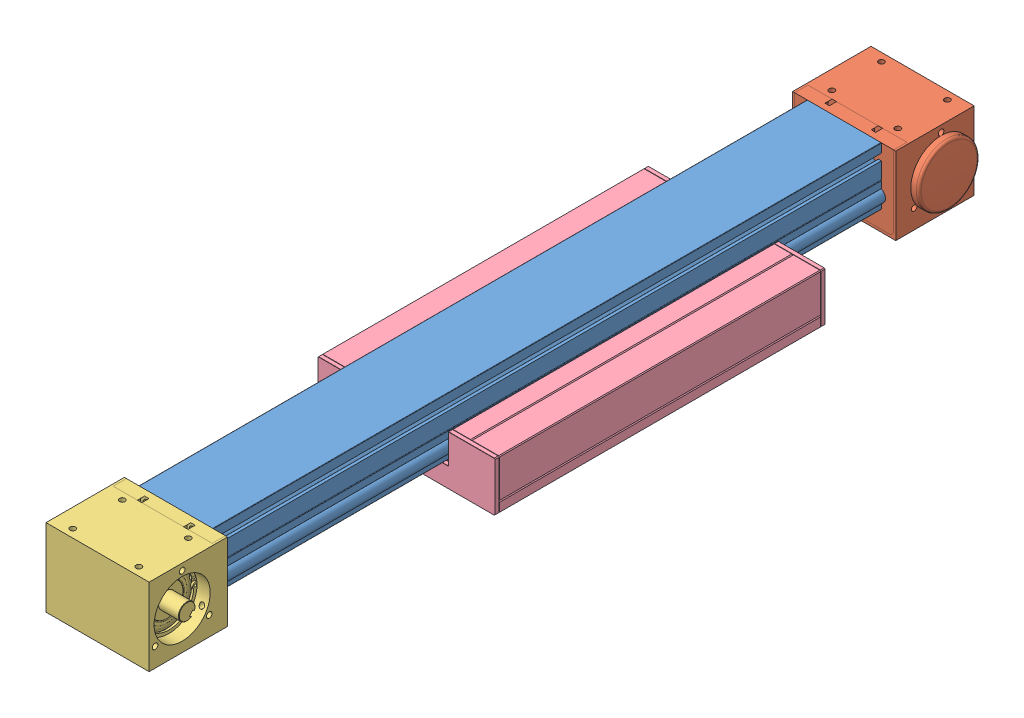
SolidWorks assembly MZK090_400_1000.SLDASM, configuration Standard (file format 12000). Lengths in mm.
Overall size (215 95 1000).
4 component instances, 4 part files, 8 mates.
Components (placement in the parent):
- Profil_MZ090-1: Profil_MZ090.SLDPRT [l=810] at origin size (100.1 81.5 810)
- Achskopf MZK090_ohne_Zapfen-1: Achskopf MZK090_ohne_Zapfen.SLDPRT [Standard] at (0 -13 -55) x (0 0 -1) z (-1 0 0) size (95 94 146.5)
- Achskopf MZK090_0-1: Achskopf MZK090_0.SLDPRT [Standard] at (0 -13 865) x (0 0 1) z (1 0 0) size (95 94 137)
- Schlitten_MZK090_400-1: Schlitten_MZK090_400.SLDPRT [Standard] at (0 35 330.7512) x (-1 0 0) z (0 0 1) size (215 60 400)
Mates (geometry in assembly coordinates):
- Deckungsgleich1: coincident aligned: plane of Achskopf MZK090_ohne_Zapfen-1 through (-62.5 35 0) normal (0 1 0); plane of Profil_MZ090-1 through (-45 35 810) normal (0 1 0)
- Deckungsgleich2: coincident anti-aligned: plane of Profil_MZ090-1 through (-45 35 0) normal (0 0 -1); plane of Achskopf MZK090_ohne_Zapfen-1 through (54 -50 0) normal (0 0 1)
- Breite1: width anti-aligned: plane of Achskopf MZK090_ohne_Zapfen-1 through (-62.5 -59 0) normal (-1 0 0); plane of Profil_MZ090-1 through (62.5 -59 0) normal (1 0 0); plane of Achskopf MZK090_ohne_Zapfen-1 through (45 35 810) normal (1 0 0); plane of Profil_MZ090-1 through (-45 35 810) normal (-1 0 0)
- Deckungsgleich3: coincident aligned: plane of Achskopf MZK090_0-1 through (62.5 35 810) normal (0 1 0); plane of Profil_MZ090-1 through (-45 35 810) normal (0 1 0)
- Deckungsgleich4: coincident anti-aligned: plane of Achskopf MZK090_0-1 through (-54 -50 810) normal (0 0 -1); plane of Profil_MZ090-1 through (-45 35 810) normal (0 0 1)
- Breite2: width anti-aligned: plane of Achskopf MZK090_0-1 through (-62.5 -59 810) normal (-1 0 0); plane of Profil_MZ090-1 through (62.5 -59 810) normal (1 0 0); plane of Achskopf MZK090_0-1 through (45 35 810) normal (1 0 0); plane of Profil_MZ090-1 through (-45 35 810) normal (-1 0 0)
- Abstand1: distance = 95 mm anti-aligned: plane of Profil_MZ090-1 through (-45 35 810) normal (0 1 0); plane of Schlitten_MZK090_400-1 through (-107.5 -60 525.7512) normal (0 -1 0)
- Breite3: width aligned: plane of Schlitten_MZK090_400-1 through (-107.5 -60 525.7512) normal (-1 0 0); plane of Profil_MZ090-1 through (107.5 -60 525.7512) normal (1 0 0); plane of Schlitten_MZK090_400-1 through (-45 35 810) normal (-1 0 0); plane of Profil_MZ090-1 through (45 35 810) normal (1 0 0)
